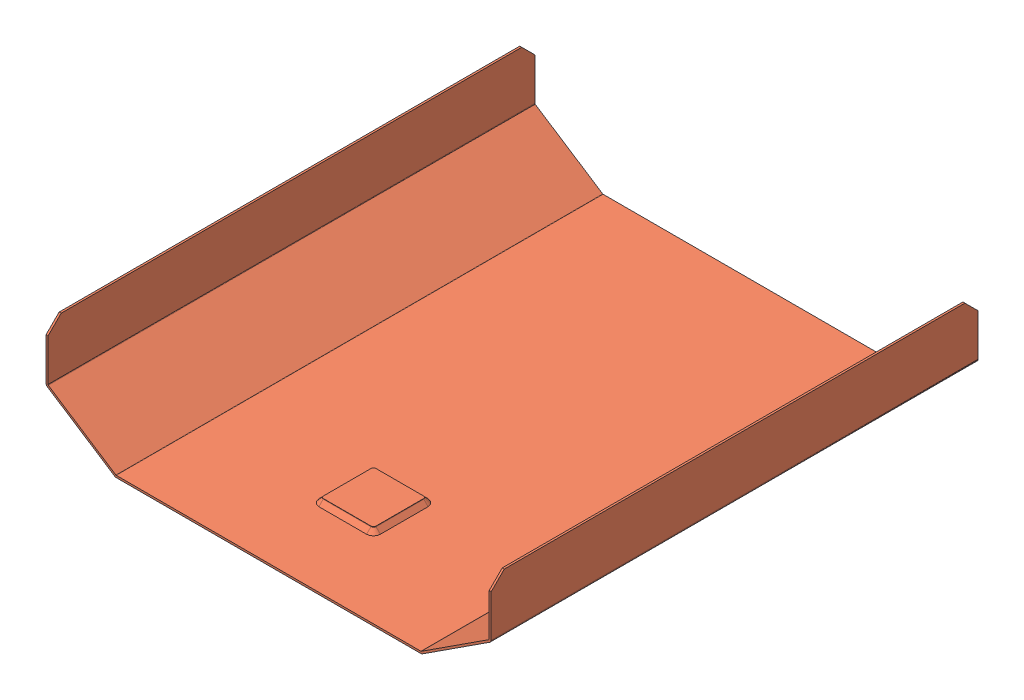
SolidWorks assembly Evolve 30M Subwoofer Grille Assembly.SLDASM, configuration Default (file format 14000). Lengths in mm.
Overall size (331 75.66 362).
2 component instances, 2 part files, 0 mates.
Components (placement in the parent):
- Evolve 30M EV Logo-1: Evolve 30M EV Logo.SLDPRT [Default] at (-197.2118 -9.383 -868.6876) size (36.94 2.75 36.94)
- Evolve 30M Subwoofer Grille-1: Evolve 30M Subwoofer Grille.SLDPRT [Default] at (-197.2118 -3.2334 -870.3526) size (331 75.66 362)
